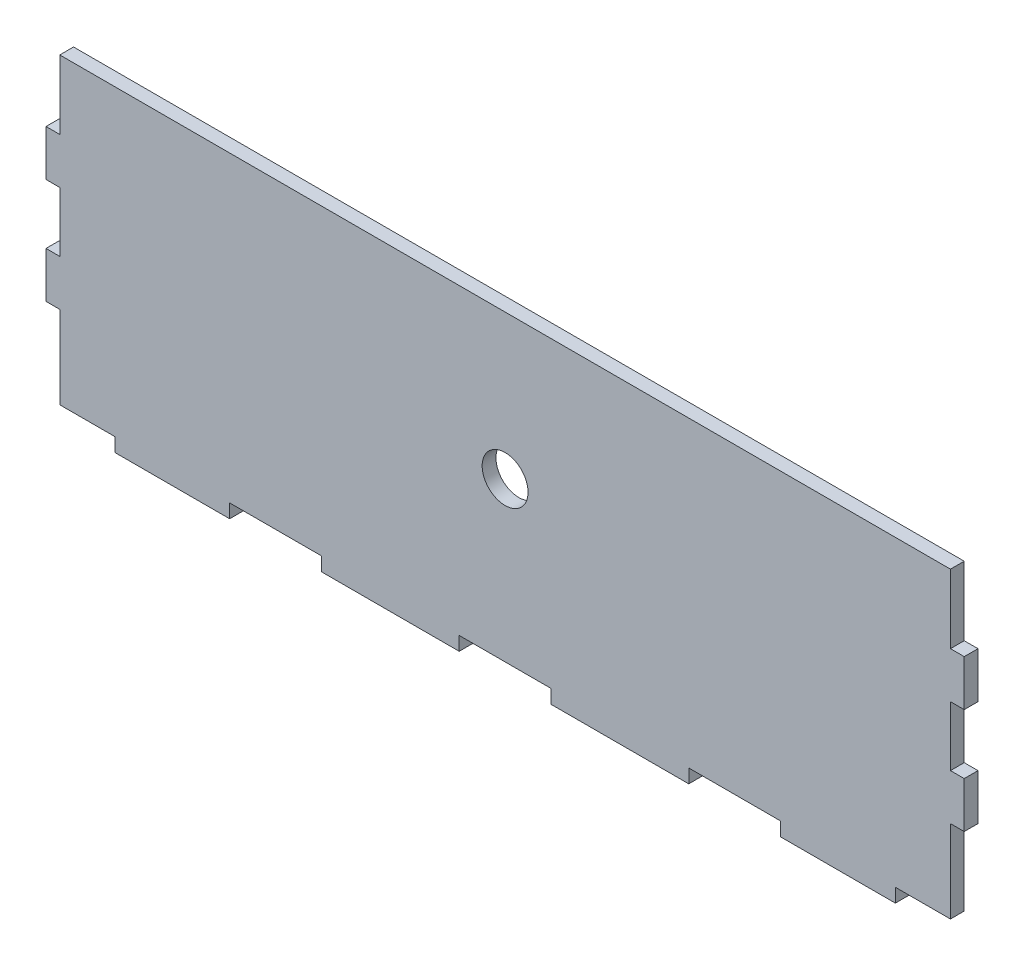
ISO-10303-21;
HEADER;
FILE_DESCRIPTION(('STEP AP214'),'2;1');
FILE_NAME('part.step','',(''),(''),'','','');
FILE_SCHEMA(('AUTOMOTIVE_DESIGN { 1 0 10303 214 1 1 1 1 }'));
ENDSEC;
DATA;
#1=APPLICATION_CONTEXT('core data for automotive mechanical design processes');
#2=APPLICATION_PROTOCOL_DEFINITION('international standard','automotive_design',2000,#1);
#3=PRODUCT_CONTEXT('',#1,'mechanical');
#4=PRODUCT('Part','Part','',(#3));
#5=PRODUCT_RELATED_PRODUCT_CATEGORY('part','',(#4));
#6=PRODUCT_DEFINITION_FORMATION('','',#4);
#7=PRODUCT_DEFINITION_CONTEXT('part definition',#1,'design');
#8=PRODUCT_DEFINITION('design','',#6,#7);
#9=PRODUCT_DEFINITION_SHAPE('','',#8);
#10=(LENGTH_UNIT() NAMED_UNIT(*) SI_UNIT(.MILLI.,.METRE.));
#11=(NAMED_UNIT(*) PLANE_ANGLE_UNIT() SI_UNIT($,.RADIAN.));
#12=(NAMED_UNIT(*) SI_UNIT($,.STERADIAN.) SOLID_ANGLE_UNIT());
#13=UNCERTAINTY_MEASURE_WITH_UNIT(LENGTH_MEASURE(1.E-05),#10,'distance_accuracy_value','');
#14=(GEOMETRIC_REPRESENTATION_CONTEXT(3) GLOBAL_UNCERTAINTY_ASSIGNED_CONTEXT((#13)) GLOBAL_UNIT_ASSIGNED_CONTEXT((#10,
#11,#12)) REPRESENTATION_CONTEXT('',''));
#15=CARTESIAN_POINT('',(0.,0.,0.));
#16=DIRECTION('',(0.,0.,1.));
#17=DIRECTION('',(1.,0.,0.));
#18=AXIS2_PLACEMENT_3D('',#15,#16,#17);
#19=CARTESIAN_POINT('',(0.,0.,3.));
#20=DIRECTION('',(1.,0.,0.));
#21=DIRECTION('',(0.,0.,-1.));
#22=AXIS2_PLACEMENT_3D('',#19,#20,#21);
#23=PLANE('',#22);
#24=DIRECTION('',(0.,-1.,0.));
#25=VECTOR('',#24,1.);
#26=CARTESIAN_POINT('',(0.,0.,3.));
#27=LINE('',#26,#25);
#28=CARTESIAN_POINT('',(0.,31.,3.));
#29=VERTEX_POINT('',#28);
#30=CARTESIAN_POINT('',(0.,21.,3.));
#31=VERTEX_POINT('',#30);
#32=EDGE_CURVE('E300',#29,#31,#27,.T.);
#33=ORIENTED_EDGE('',*,*,#32,.F.);
#34=DIRECTION('',(0.,0.,1.));
#35=VECTOR('',#34,1.);
#36=CARTESIAN_POINT('',(0.,31.,-3.));
#37=LINE('',#36,#35);
#38=CARTESIAN_POINT('',(0.,31.,0.));
#39=VERTEX_POINT('',#38);
#40=EDGE_CURVE('E488',#39,#29,#37,.T.);
#41=ORIENTED_EDGE('',*,*,#40,.F.);
#42=DIRECTION('',(0.,-1.,0.));
#43=VECTOR('',#42,1.);
#44=CARTESIAN_POINT('',(0.,0.,0.));
#45=LINE('',#44,#43);
#46=CARTESIAN_POINT('',(0.,21.,0.));
#47=VERTEX_POINT('',#46);
#48=EDGE_CURVE('E318',#39,#47,#45,.T.);
#49=ORIENTED_EDGE('',*,*,#48,.T.);
#50=DIRECTION('',(0.,0.,1.));
#51=VECTOR('',#50,1.);
#52=CARTESIAN_POINT('',(0.,21.,-3.));
#53=LINE('',#52,#51);
#54=EDGE_CURVE('E585',#47,#31,#53,.T.);
#55=ORIENTED_EDGE('',*,*,#54,.T.);
#56=EDGE_LOOP('',(#33,#41,#49,#55));
#57=FACE_BOUND('',#56,.T.);
#58=ADVANCED_FACE('F39',(#57),#23,.F.);
#59=CARTESIAN_POINT('',(0.,0.,3.));
#60=DIRECTION('',(0.,1.,0.));
#61=DIRECTION('',(0.,0.,1.));
#62=AXIS2_PLACEMENT_3D('',#59,#60,#61);
#63=PLANE('',#62);
#64=DIRECTION('',(1.,0.,0.));
#65=VECTOR('',#64,1.);
#66=CARTESIAN_POINT('',(0.,0.,3.));
#67=LINE('',#66,#65);
#68=CARTESIAN_POINT('',(60.,0.,3.));
#69=VERTEX_POINT('',#68);
#70=CARTESIAN_POINT('',(90.,0.,3.));
#71=VERTEX_POINT('',#70);
#72=EDGE_CURVE('E750',#69,#71,#67,.T.);
#73=ORIENTED_EDGE('',*,*,#72,.F.);
#74=DIRECTION('',(0.,0.,1.));
#75=VECTOR('',#74,1.);
#76=CARTESIAN_POINT('',(60.,0.,-3.));
#77=LINE('',#76,#75);
#78=CARTESIAN_POINT('',(60.,0.,0.));
#79=VERTEX_POINT('',#78);
#80=EDGE_CURVE('E464',#79,#69,#77,.T.);
#81=ORIENTED_EDGE('',*,*,#80,.F.);
#82=DIRECTION('',(1.,0.,0.));
#83=VECTOR('',#82,1.);
#84=CARTESIAN_POINT('',(0.,0.,0.));
#85=LINE('',#84,#83);
#86=CARTESIAN_POINT('',(90.,0.,0.));
#87=VERTEX_POINT('',#86);
#88=EDGE_CURVE('E709',#79,#87,#85,.T.);
#89=ORIENTED_EDGE('',*,*,#88,.T.);
#90=DIRECTION('',(0.,0.,1.));
#91=VECTOR('',#90,1.);
#92=CARTESIAN_POINT('',(90.,0.,-3.));
#93=LINE('',#92,#91);
#94=EDGE_CURVE('E564',#87,#71,#93,.T.);
#95=ORIENTED_EDGE('',*,*,#94,.T.);
#96=EDGE_LOOP('',(#73,#81,#89,#95));
#97=FACE_BOUND('',#96,.T.);
#98=ADVANCED_FACE('F671',(#97),#63,.F.);
#99=CARTESIAN_POINT('',(160.,0.,0.));
#100=VERTEX_POINT('',#99);
#101=CARTESIAN_POINT('',(185.,0.,0.));
#102=VERTEX_POINT('',#101);
#103=EDGE_CURVE('E324',#100,#102,#85,.T.);
#104=ORIENTED_EDGE('',*,*,#103,.T.);
#105=DIRECTION('',(0.,0.,1.));
#106=VECTOR('',#105,1.);
#107=CARTESIAN_POINT('',(185.,0.,-3.));
#108=LINE('',#107,#106);
#109=CARTESIAN_POINT('',(185.,0.,3.));
#110=VERTEX_POINT('',#109);
#111=EDGE_CURVE('E311',#102,#110,#108,.T.);
#112=ORIENTED_EDGE('',*,*,#111,.T.);
#113=CARTESIAN_POINT('',(160.,0.,3.));
#114=VERTEX_POINT('',#113);
#115=EDGE_CURVE('E299',#114,#110,#67,.T.);
#116=ORIENTED_EDGE('',*,*,#115,.F.);
#117=DIRECTION('',(0.,0.,1.));
#118=VECTOR('',#117,1.);
#119=CARTESIAN_POINT('',(160.,0.,-3.));
#120=LINE('',#119,#118);
#121=EDGE_CURVE('E539',#100,#114,#120,.T.);
#122=ORIENTED_EDGE('',*,*,#121,.F.);
#123=EDGE_LOOP('',(#104,#112,#116,#122));
#124=FACE_BOUND('',#123,.T.);
#125=ADVANCED_FACE('F629',(#124),#63,.F.);
#126=CARTESIAN_POINT('',(110.,0.,0.));
#127=VERTEX_POINT('',#126);
#128=CARTESIAN_POINT('',(140.,0.,0.));
#129=VERTEX_POINT('',#128);
#130=EDGE_CURVE('E328',#127,#129,#85,.T.);
#131=ORIENTED_EDGE('',*,*,#130,.T.);
#132=DIRECTION('',(0.,0.,1.));
#133=VECTOR('',#132,1.);
#134=CARTESIAN_POINT('',(140.,0.,-3.));
#135=LINE('',#134,#133);
#136=CARTESIAN_POINT('',(140.,0.,3.));
#137=VERTEX_POINT('',#136);
#138=EDGE_CURVE('E542',#129,#137,#135,.T.);
#139=ORIENTED_EDGE('',*,*,#138,.T.);
#140=CARTESIAN_POINT('',(110.,0.,3.));
#141=VERTEX_POINT('',#140);
#142=EDGE_CURVE('E305',#141,#137,#67,.T.);
#143=ORIENTED_EDGE('',*,*,#142,.F.);
#144=DIRECTION('',(0.,0.,1.));
#145=VECTOR('',#144,1.);
#146=CARTESIAN_POINT('',(110.,0.,-3.));
#147=LINE('',#146,#145);
#148=EDGE_CURVE('E561',#127,#141,#147,.T.);
#149=ORIENTED_EDGE('',*,*,#148,.F.);
#150=EDGE_LOOP('',(#131,#139,#143,#149));
#151=FACE_BOUND('',#150,.T.);
#152=ADVANCED_FACE('F687',(#151),#63,.F.);
#153=CARTESIAN_POINT('',(200.,0.,3.));
#154=DIRECTION('',(-1.,0.,0.));
#155=DIRECTION('',(0.,0.,1.));
#156=AXIS2_PLACEMENT_3D('',#153,#154,#155);
#157=PLANE('',#156);
#158=DIRECTION('',(0.,1.,0.));
#159=VECTOR('',#158,1.);
#160=CARTESIAN_POINT('',(200.,0.,0.));
#161=LINE('',#160,#159);
#162=CARTESIAN_POINT('',(200.,44.,0.));
#163=VERTEX_POINT('',#162);
#164=CARTESIAN_POINT('',(200.,54.,0.));
#165=VERTEX_POINT('',#164);
#166=EDGE_CURVE('E330',#163,#165,#161,.T.);
#167=ORIENTED_EDGE('',*,*,#166,.T.);
#168=DIRECTION('',(0.,0.,1.));
#169=VECTOR('',#168,1.);
#170=CARTESIAN_POINT('',(200.,54.,-3.));
#171=LINE('',#170,#169);
#172=CARTESIAN_POINT('',(200.,54.,3.));
#173=VERTEX_POINT('',#172);
#174=EDGE_CURVE('E407',#165,#173,#171,.T.);
#175=ORIENTED_EDGE('',*,*,#174,.T.);
#176=DIRECTION('',(0.,1.,0.));
#177=VECTOR('',#176,1.);
#178=CARTESIAN_POINT('',(200.,0.,3.));
#179=LINE('',#178,#177);
#180=CARTESIAN_POINT('',(200.,44.,3.));
#181=VERTEX_POINT('',#180);
#182=EDGE_CURVE('E314',#181,#173,#179,.T.);
#183=ORIENTED_EDGE('',*,*,#182,.F.);
#184=DIRECTION('',(0.,0.,1.));
#185=VECTOR('',#184,1.);
#186=CARTESIAN_POINT('',(200.,44.,-3.));
#187=LINE('',#186,#185);
#188=EDGE_CURVE('E510',#163,#181,#187,.T.);
#189=ORIENTED_EDGE('',*,*,#188,.F.);
#190=EDGE_LOOP('',(#167,#175,#183,#189));
#191=FACE_BOUND('',#190,.T.);
#192=ADVANCED_FACE('F680',(#191),#157,.F.);
#193=CARTESIAN_POINT('',(0.,54.,3.));
#194=VERTEX_POINT('',#193);
#195=CARTESIAN_POINT('',(0.,44.,3.));
#196=VERTEX_POINT('',#195);
#197=EDGE_CURVE('E289',#194,#196,#27,.T.);
#198=ORIENTED_EDGE('',*,*,#197,.F.);
#199=DIRECTION('',(0.,0.,1.));
#200=VECTOR('',#199,1.);
#201=CARTESIAN_POINT('',(0.,54.,-3.));
#202=LINE('',#201,#200);
#203=CARTESIAN_POINT('',(0.,54.,0.));
#204=VERTEX_POINT('',#203);
#205=EDGE_CURVE('E270',#204,#194,#202,.T.);
#206=ORIENTED_EDGE('',*,*,#205,.F.);
#207=CARTESIAN_POINT('',(0.,44.,0.));
#208=VERTEX_POINT('',#207);
#209=EDGE_CURVE('E322',#204,#208,#45,.T.);
#210=ORIENTED_EDGE('',*,*,#209,.T.);
#211=DIRECTION('',(0.,0.,1.));
#212=VECTOR('',#211,1.);
#213=CARTESIAN_POINT('',(0.,44.,-3.));
#214=LINE('',#213,#212);
#215=EDGE_CURVE('E297',#208,#196,#214,.T.);
#216=ORIENTED_EDGE('',*,*,#215,.T.);
#217=EDGE_LOOP('',(#198,#206,#210,#216));
#218=FACE_BOUND('',#217,.T.);
#219=ADVANCED_FACE('F41',(#218),#23,.F.);
#220=CARTESIAN_POINT('',(15.,0.,0.));
#221=VERTEX_POINT('',#220);
#222=CARTESIAN_POINT('',(40.,0.,0.));
#223=VERTEX_POINT('',#222);
#224=EDGE_CURVE('E329',#221,#223,#85,.T.);
#225=ORIENTED_EDGE('',*,*,#224,.T.);
#226=DIRECTION('',(0.,0.,1.));
#227=VECTOR('',#226,1.);
#228=CARTESIAN_POINT('',(40.,0.,-3.));
#229=LINE('',#228,#227);
#230=CARTESIAN_POINT('',(40.,0.,3.));
#231=VERTEX_POINT('',#230);
#232=EDGE_CURVE('E467',#223,#231,#229,.T.);
#233=ORIENTED_EDGE('',*,*,#232,.T.);
#234=CARTESIAN_POINT('',(15.,0.,3.));
#235=VERTEX_POINT('',#234);
#236=EDGE_CURVE('E307',#235,#231,#67,.T.);
#237=ORIENTED_EDGE('',*,*,#236,.F.);
#238=DIRECTION('',(0.,0.,1.));
#239=VECTOR('',#238,1.);
#240=CARTESIAN_POINT('',(15.,0.,-3.));
#241=LINE('',#240,#239);
#242=EDGE_CURVE('E593',#221,#235,#241,.T.);
#243=ORIENTED_EDGE('',*,*,#242,.F.);
#244=EDGE_LOOP('',(#225,#233,#237,#243));
#245=FACE_BOUND('',#244,.T.);
#246=ADVANCED_FACE('F677',(#245),#63,.F.);
#247=CARTESIAN_POINT('',(200.,21.,0.));
#248=VERTEX_POINT('',#247);
#249=CARTESIAN_POINT('',(200.,31.,0.));
#250=VERTEX_POINT('',#249);
#251=EDGE_CURVE('E309',#248,#250,#161,.T.);
#252=ORIENTED_EDGE('',*,*,#251,.T.);
#253=DIRECTION('',(0.,0.,1.));
#254=VECTOR('',#253,1.);
#255=CARTESIAN_POINT('',(200.,31.,-3.));
#256=LINE('',#255,#254);
#257=CARTESIAN_POINT('',(200.,31.,3.));
#258=VERTEX_POINT('',#257);
#259=EDGE_CURVE('E513',#250,#258,#256,.T.);
#260=ORIENTED_EDGE('',*,*,#259,.T.);
#261=CARTESIAN_POINT('',(200.,21.,3.));
#262=VERTEX_POINT('',#261);
#263=EDGE_CURVE('E317',#262,#258,#179,.T.);
#264=ORIENTED_EDGE('',*,*,#263,.F.);
#265=DIRECTION('',(0.,0.,1.));
#266=VECTOR('',#265,1.);
#267=CARTESIAN_POINT('',(200.,21.,-3.));
#268=LINE('',#267,#266);
#269=EDGE_CURVE('E620',#248,#262,#268,.T.);
#270=ORIENTED_EDGE('',*,*,#269,.F.);
#271=EDGE_LOOP('',(#252,#260,#264,#270));
#272=FACE_BOUND('',#271,.T.);
#273=ADVANCED_FACE('F685',(#272),#157,.F.);
#274=CARTESIAN_POINT('',(0.,0.,3.));
#275=DIRECTION('',(0.,0.,-1.));
#276=DIRECTION('',(-1.,0.,0.));
#277=AXIS2_PLACEMENT_3D('',#274,#275,#276);
#278=PLANE('',#277);
#279=CARTESIAN_POINT('',(100.,37.5,3.));
#280=DIRECTION('',(0.,0.,1.));
#281=DIRECTION('',(1.,0.,0.));
#282=AXIS2_PLACEMENT_3D('',#279,#280,#281);
#283=CIRCLE('',#282,5.00000000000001);
#284=CARTESIAN_POINT('',(105.,37.5,3.));
#285=VERTEX_POINT('',#284);
#286=EDGE_CURVE('E500',#285,#285,#283,.T.);
#287=ORIENTED_EDGE('',*,*,#286,.F.);
#288=EDGE_LOOP('',(#287));
#289=FACE_BOUND('',#288,.T.);
#290=ORIENTED_EDGE('',*,*,#182,.T.);
#291=DIRECTION('',(1.,0.,0.));
#292=VECTOR('',#291,1.);
#293=CARTESIAN_POINT('',(200.,54.,3.));
#294=LINE('',#293,#292);
#295=CARTESIAN_POINT('',(197.,54.,3.));
#296=VERTEX_POINT('',#295);
#297=EDGE_CURVE('E282',#296,#173,#294,.T.);
#298=ORIENTED_EDGE('',*,*,#297,.F.);
#299=DIRECTION('',(0.,-1.,0.));
#300=VECTOR('',#299,1.);
#301=CARTESIAN_POINT('',(197.,54.,3.));
#302=LINE('',#301,#300);
#303=CARTESIAN_POINT('',(197.,69.,3.));
#304=VERTEX_POINT('',#303);
#305=EDGE_CURVE('E722',#304,#296,#302,.T.);
#306=ORIENTED_EDGE('',*,*,#305,.F.);
#307=DIRECTION('',(1.,0.,0.));
#308=VECTOR('',#307,1.);
#309=CARTESIAN_POINT('',(197.,69.,3.));
#310=LINE('',#309,#308);
#311=CARTESIAN_POINT('',(3.,69.,3.));
#312=VERTEX_POINT('',#311);
#313=EDGE_CURVE('E431',#312,#304,#310,.T.);
#314=ORIENTED_EDGE('',*,*,#313,.F.);
#315=DIRECTION('',(0.,1.,0.));
#316=VECTOR('',#315,1.);
#317=CARTESIAN_POINT('',(3.,69.,3.));
#318=LINE('',#317,#316);
#319=CARTESIAN_POINT('',(3.,54.,3.));
#320=VERTEX_POINT('',#319);
#321=EDGE_CURVE('E292',#320,#312,#318,.T.);
#322=ORIENTED_EDGE('',*,*,#321,.F.);
#323=DIRECTION('',(1.,0.,0.));
#324=VECTOR('',#323,1.);
#325=CARTESIAN_POINT('',(3.,54.,3.));
#326=LINE('',#325,#324);
#327=EDGE_CURVE('E273',#194,#320,#326,.T.);
#328=ORIENTED_EDGE('',*,*,#327,.F.);
#329=ORIENTED_EDGE('',*,*,#197,.T.);
#330=DIRECTION('',(-1.,0.,0.));
#331=VECTOR('',#330,1.);
#332=CARTESIAN_POINT('',(3.,44.,3.));
#333=LINE('',#332,#331);
#334=CARTESIAN_POINT('',(3.,44.,3.));
#335=VERTEX_POINT('',#334);
#336=EDGE_CURVE('E477',#335,#196,#333,.T.);
#337=ORIENTED_EDGE('',*,*,#336,.F.);
#338=DIRECTION('',(0.,1.,0.));
#339=VECTOR('',#338,1.);
#340=CARTESIAN_POINT('',(3.,44.,3.));
#341=LINE('',#340,#339);
#342=CARTESIAN_POINT('',(3.,31.,3.));
#343=VERTEX_POINT('',#342);
#344=EDGE_CURVE('E473',#343,#335,#341,.T.);
#345=ORIENTED_EDGE('',*,*,#344,.F.);
#346=DIRECTION('',(1.,0.,0.));
#347=VECTOR('',#346,1.);
#348=CARTESIAN_POINT('',(3.,31.,3.));
#349=LINE('',#348,#347);
#350=EDGE_CURVE('E481',#29,#343,#349,.T.);
#351=ORIENTED_EDGE('',*,*,#350,.F.);
#352=ORIENTED_EDGE('',*,*,#32,.T.);
#353=DIRECTION('',(-1.,0.,0.));
#354=VECTOR('',#353,1.);
#355=CARTESIAN_POINT('',(3.,21.,3.));
#356=LINE('',#355,#354);
#357=CARTESIAN_POINT('',(3.,21.,3.));
#358=VERTEX_POINT('',#357);
#359=EDGE_CURVE('E570',#358,#31,#356,.T.);
#360=ORIENTED_EDGE('',*,*,#359,.F.);
#361=DIRECTION('',(0.,1.,0.));
#362=VECTOR('',#361,1.);
#363=CARTESIAN_POINT('',(3.00000000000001,3.,3.));
#364=LINE('',#363,#362);
#365=CARTESIAN_POINT('',(3.00000000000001,3.,3.));
#366=VERTEX_POINT('',#365);
#367=EDGE_CURVE('E581',#366,#358,#364,.T.);
#368=ORIENTED_EDGE('',*,*,#367,.F.);
#369=DIRECTION('',(-1.,0.,0.));
#370=VECTOR('',#369,1.);
#371=CARTESIAN_POINT('',(15.,3.,3.));
#372=LINE('',#371,#370);
#373=CARTESIAN_POINT('',(15.,3.,3.));
#374=VERTEX_POINT('',#373);
#375=EDGE_CURVE('E577',#374,#366,#372,.T.);
#376=ORIENTED_EDGE('',*,*,#375,.F.);
#377=DIRECTION('',(0.,1.,0.));
#378=VECTOR('',#377,1.);
#379=CARTESIAN_POINT('',(15.,0.,3.));
#380=LINE('',#379,#378);
#381=EDGE_CURVE('E573',#235,#374,#380,.T.);
#382=ORIENTED_EDGE('',*,*,#381,.F.);
#383=ORIENTED_EDGE('',*,*,#236,.T.);
#384=DIRECTION('',(0.,-1.,0.));
#385=VECTOR('',#384,1.);
#386=CARTESIAN_POINT('',(40.,3.,3.));
#387=LINE('',#386,#385);
#388=CARTESIAN_POINT('',(40.,3.,3.));
#389=VERTEX_POINT('',#388);
#390=EDGE_CURVE('E451',#389,#231,#387,.T.);
#391=ORIENTED_EDGE('',*,*,#390,.F.);
#392=DIRECTION('',(-1.,0.,0.));
#393=VECTOR('',#392,1.);
#394=CARTESIAN_POINT('',(40.,3.,3.));
#395=LINE('',#394,#393);
#396=CARTESIAN_POINT('',(60.,3.,3.));
#397=VERTEX_POINT('',#396);
#398=EDGE_CURVE('E447',#397,#389,#395,.T.);
#399=ORIENTED_EDGE('',*,*,#398,.F.);
#400=DIRECTION('',(0.,1.,0.));
#401=VECTOR('',#400,1.);
#402=CARTESIAN_POINT('',(60.,3.,3.));
#403=LINE('',#402,#401);
#404=EDGE_CURVE('E455',#69,#397,#403,.T.);
#405=ORIENTED_EDGE('',*,*,#404,.F.);
#406=ORIENTED_EDGE('',*,*,#72,.T.);
#407=DIRECTION('',(0.,-1.,0.));
#408=VECTOR('',#407,1.);
#409=CARTESIAN_POINT('',(90.,3.,3.));
#410=LINE('',#409,#408);
#411=CARTESIAN_POINT('',(90.,3.,3.));
#412=VERTEX_POINT('',#411);
#413=EDGE_CURVE('E551',#412,#71,#410,.T.);
#414=ORIENTED_EDGE('',*,*,#413,.F.);
#415=DIRECTION('',(-1.,0.,0.));
#416=VECTOR('',#415,1.);
#417=CARTESIAN_POINT('',(90.,3.,3.));
#418=LINE('',#417,#416);
#419=CARTESIAN_POINT('',(110.,3.,3.));
#420=VERTEX_POINT('',#419);
#421=EDGE_CURVE('E463',#420,#412,#418,.T.);
#422=ORIENTED_EDGE('',*,*,#421,.F.);
#423=DIRECTION('',(0.,1.,0.));
#424=VECTOR('',#423,1.);
#425=CARTESIAN_POINT('',(110.,3.,3.));
#426=LINE('',#425,#424);
#427=EDGE_CURVE('E554',#141,#420,#426,.T.);
#428=ORIENTED_EDGE('',*,*,#427,.F.);
#429=ORIENTED_EDGE('',*,*,#142,.T.);
#430=DIRECTION('',(0.,-1.,0.));
#431=VECTOR('',#430,1.);
#432=CARTESIAN_POINT('',(140.,3.,3.));
#433=LINE('',#432,#431);
#434=CARTESIAN_POINT('',(140.,3.,3.));
#435=VERTEX_POINT('',#434);
#436=EDGE_CURVE('E526',#435,#137,#433,.T.);
#437=ORIENTED_EDGE('',*,*,#436,.F.);
#438=DIRECTION('',(-1.,0.,0.));
#439=VECTOR('',#438,1.);
#440=CARTESIAN_POINT('',(140.,3.,3.));
#441=LINE('',#440,#439);
#442=CARTESIAN_POINT('',(160.,3.,3.));
#443=VERTEX_POINT('',#442);
#444=EDGE_CURVE('E522',#443,#435,#441,.T.);
#445=ORIENTED_EDGE('',*,*,#444,.F.);
#446=DIRECTION('',(0.,1.,0.));
#447=VECTOR('',#446,1.);
#448=CARTESIAN_POINT('',(160.,3.,3.));
#449=LINE('',#448,#447);
#450=EDGE_CURVE('E530',#114,#443,#449,.T.);
#451=ORIENTED_EDGE('',*,*,#450,.F.);
#452=ORIENTED_EDGE('',*,*,#115,.T.);
#453=DIRECTION('',(0.,-1.,0.));
#454=VECTOR('',#453,1.);
#455=CARTESIAN_POINT('',(185.,0.,3.));
#456=LINE('',#455,#454);
#457=CARTESIAN_POINT('',(185.,3.,3.));
#458=VERTEX_POINT('',#457);
#459=EDGE_CURVE('E538',#458,#110,#456,.T.);
#460=ORIENTED_EDGE('',*,*,#459,.F.);
#461=DIRECTION('',(-1.,0.,0.));
#462=VECTOR('',#461,1.);
#463=CARTESIAN_POINT('',(185.,3.,3.));
#464=LINE('',#463,#462);
#465=CARTESIAN_POINT('',(197.000000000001,3.00000000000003,3.));
#466=VERTEX_POINT('',#465);
#467=EDGE_CURVE('E609',#466,#458,#464,.T.);
#468=ORIENTED_EDGE('',*,*,#467,.F.);
#469=DIRECTION('',(0.,-1.,0.));
#470=VECTOR('',#469,1.);
#471=CARTESIAN_POINT('',(197.000000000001,21.,3.));
#472=LINE('',#471,#470);
#473=CARTESIAN_POINT('',(197.000000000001,21.,3.));
#474=VERTEX_POINT('',#473);
#475=EDGE_CURVE('E605',#474,#466,#472,.T.);
#476=ORIENTED_EDGE('',*,*,#475,.F.);
#477=DIRECTION('',(-1.,0.,0.));
#478=VECTOR('',#477,1.);
#479=CARTESIAN_POINT('',(197.000000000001,21.,3.));
#480=LINE('',#479,#478);
#481=EDGE_CURVE('E601',#262,#474,#480,.T.);
#482=ORIENTED_EDGE('',*,*,#481,.F.);
#483=ORIENTED_EDGE('',*,*,#263,.T.);
#484=DIRECTION('',(1.,0.,0.));
#485=VECTOR('',#484,1.);
#486=CARTESIAN_POINT('',(197.,31.,3.));
#487=LINE('',#486,#485);
#488=CARTESIAN_POINT('',(197.,31.,3.));
#489=VERTEX_POINT('',#488);
#490=EDGE_CURVE('E499',#489,#258,#487,.T.);
#491=ORIENTED_EDGE('',*,*,#490,.F.);
#492=DIRECTION('',(0.,-1.,0.));
#493=VECTOR('',#492,1.);
#494=CARTESIAN_POINT('',(197.,31.,3.));
#495=LINE('',#494,#493);
#496=CARTESIAN_POINT('',(197.,44.,3.));
#497=VERTEX_POINT('',#496);
#498=EDGE_CURVE('E495',#497,#489,#495,.T.);
#499=ORIENTED_EDGE('',*,*,#498,.F.);
#500=DIRECTION('',(-1.,0.,0.));
#501=VECTOR('',#500,1.);
#502=CARTESIAN_POINT('',(197.,44.,3.));
#503=LINE('',#502,#501);
#504=EDGE_CURVE('E503',#181,#497,#503,.T.);
#505=ORIENTED_EDGE('',*,*,#504,.F.);
#506=EDGE_LOOP('',(#290,#298,#306,#314,#322,#328,#329,#337,#345,#351,#352,#360,#368,#376,#382,
#383,#391,#399,#405,#406,#414,#422,#428,#429,#437,#445,#451,#452,#460,#468,#476,#482,#483,#491,
#499,#505));
#507=FACE_BOUND('',#506,.T.);
#508=ADVANCED_FACE('F287',(#289,#507),#278,.F.);
#509=CARTESIAN_POINT('',(0.,0.,0.));
#510=DIRECTION('',(0.,0.,-1.));
#511=DIRECTION('',(-1.,0.,0.));
#512=AXIS2_PLACEMENT_3D('',#509,#510,#511);
#513=PLANE('',#512);
#514=DIRECTION('',(-1.,0.,0.));
#515=VECTOR('',#514,1.);
#516=CARTESIAN_POINT('',(0.,54.,0.));
#517=LINE('',#516,#515);
#518=CARTESIAN_POINT('',(197.,54.,0.));
#519=VERTEX_POINT('',#518);
#520=EDGE_CURVE('E11',#165,#519,#517,.T.);
#521=ORIENTED_EDGE('',*,*,#520,.F.);
#522=ORIENTED_EDGE('',*,*,#166,.F.);
#523=DIRECTION('',(1.,0.,0.));
#524=VECTOR('',#523,1.);
#525=CARTESIAN_POINT('',(0.,44.,0.));
#526=LINE('',#525,#524);
#527=CARTESIAN_POINT('',(197.,44.,0.));
#528=VERTEX_POINT('',#527);
#529=EDGE_CURVE('E401',#528,#163,#526,.T.);
#530=ORIENTED_EDGE('',*,*,#529,.F.);
#531=DIRECTION('',(0.,1.,0.));
#532=VECTOR('',#531,1.);
#533=CARTESIAN_POINT('',(197.,0.,0.));
#534=LINE('',#533,#532);
#535=CARTESIAN_POINT('',(197.,31.,0.));
#536=VERTEX_POINT('',#535);
#537=EDGE_CURVE('E398',#536,#528,#534,.T.);
#538=ORIENTED_EDGE('',*,*,#537,.F.);
#539=DIRECTION('',(-1.,0.,0.));
#540=VECTOR('',#539,1.);
#541=CARTESIAN_POINT('',(0.,31.,0.));
#542=LINE('',#541,#540);
#543=EDGE_CURVE('E395',#250,#536,#542,.T.);
#544=ORIENTED_EDGE('',*,*,#543,.F.);
#545=ORIENTED_EDGE('',*,*,#251,.F.);
#546=DIRECTION('',(1.,0.,0.));
#547=VECTOR('',#546,1.);
#548=CARTESIAN_POINT('',(1.94289029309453E-13,21.0000000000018,0.));
#549=LINE('',#548,#547);
#550=CARTESIAN_POINT('',(197.000000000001,21.,0.));
#551=VERTEX_POINT('',#550);
#552=EDGE_CURVE('E352',#551,#248,#549,.T.);
#553=ORIENTED_EDGE('',*,*,#552,.F.);
#554=DIRECTION('',(0.,1.,0.));
#555=VECTOR('',#554,1.);
#556=CARTESIAN_POINT('',(197.000000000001,0.,0.));
#557=LINE('',#556,#555);
#558=CARTESIAN_POINT('',(197.000000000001,3.00000000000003,0.));
#559=VERTEX_POINT('',#558);
#560=EDGE_CURVE('E355',#559,#551,#557,.T.);
#561=ORIENTED_EDGE('',*,*,#560,.F.);
#562=DIRECTION('',(1.,0.,0.));
#563=VECTOR('',#562,1.);
#564=CARTESIAN_POINT('',(0.,2.99999999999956,0.));
#565=LINE('',#564,#563);
#566=CARTESIAN_POINT('',(185.,3.,0.));
#567=VERTEX_POINT('',#566);
#568=EDGE_CURVE('E359',#567,#559,#565,.T.);
#569=ORIENTED_EDGE('',*,*,#568,.F.);
#570=DIRECTION('',(0.,1.,0.));
#571=VECTOR('',#570,1.);
#572=CARTESIAN_POINT('',(185.,0.,0.));
#573=LINE('',#572,#571);
#574=EDGE_CURVE('E362',#102,#567,#573,.T.);
#575=ORIENTED_EDGE('',*,*,#574,.F.);
#576=ORIENTED_EDGE('',*,*,#103,.F.);
#577=DIRECTION('',(0.,-1.,0.));
#578=VECTOR('',#577,1.);
#579=CARTESIAN_POINT('',(160.,0.,0.));
#580=LINE('',#579,#578);
#581=CARTESIAN_POINT('',(160.,3.,0.));
#582=VERTEX_POINT('',#581);
#583=EDGE_CURVE('E349',#582,#100,#580,.T.);
#584=ORIENTED_EDGE('',*,*,#583,.F.);
#585=DIRECTION('',(1.,0.,0.));
#586=VECTOR('',#585,1.);
#587=CARTESIAN_POINT('',(0.,3.,0.));
#588=LINE('',#587,#586);
#589=CARTESIAN_POINT('',(140.,3.,0.));
#590=VERTEX_POINT('',#589);
#591=EDGE_CURVE('E346',#590,#582,#588,.T.);
#592=ORIENTED_EDGE('',*,*,#591,.F.);
#593=DIRECTION('',(0.,1.,0.));
#594=VECTOR('',#593,1.);
#595=CARTESIAN_POINT('',(140.,0.,0.));
#596=LINE('',#595,#594);
#597=EDGE_CURVE('E343',#129,#590,#596,.T.);
#598=ORIENTED_EDGE('',*,*,#597,.F.);
#599=ORIENTED_EDGE('',*,*,#130,.F.);
#600=DIRECTION('',(0.,-1.,0.));
#601=VECTOR('',#600,1.);
#602=CARTESIAN_POINT('',(110.,0.,0.));
#603=LINE('',#602,#601);
#604=CARTESIAN_POINT('',(110.,3.,0.));
#605=VERTEX_POINT('',#604);
#606=EDGE_CURVE('E340',#605,#127,#603,.T.);
#607=ORIENTED_EDGE('',*,*,#606,.F.);
#608=DIRECTION('',(1.,0.,0.));
#609=VECTOR('',#608,1.);
#610=CARTESIAN_POINT('',(0.,3.,0.));
#611=LINE('',#610,#609);
#612=CARTESIAN_POINT('',(90.,3.,0.));
#613=VERTEX_POINT('',#612);
#614=EDGE_CURVE('E337',#613,#605,#611,.T.);
#615=ORIENTED_EDGE('',*,*,#614,.F.);
#616=DIRECTION('',(0.,1.,0.));
#617=VECTOR('',#616,1.);
#618=CARTESIAN_POINT('',(90.,0.,0.));
#619=LINE('',#618,#617);
#620=EDGE_CURVE('E334',#87,#613,#619,.T.);
#621=ORIENTED_EDGE('',*,*,#620,.F.);
#622=ORIENTED_EDGE('',*,*,#88,.F.);
#623=DIRECTION('',(0.,-1.,0.));
#624=VECTOR('',#623,1.);
#625=CARTESIAN_POINT('',(60.,0.,0.));
#626=LINE('',#625,#624);
#627=CARTESIAN_POINT('',(60.,3.,0.));
#628=VERTEX_POINT('',#627);
#629=EDGE_CURVE('E383',#628,#79,#626,.T.);
#630=ORIENTED_EDGE('',*,*,#629,.F.);
#631=DIRECTION('',(1.,0.,0.));
#632=VECTOR('',#631,1.);
#633=CARTESIAN_POINT('',(0.,3.,0.));
#634=LINE('',#633,#632);
#635=CARTESIAN_POINT('',(40.,3.,0.));
#636=VERTEX_POINT('',#635);
#637=EDGE_CURVE('E380',#636,#628,#634,.T.);
#638=ORIENTED_EDGE('',*,*,#637,.F.);
#639=DIRECTION('',(0.,1.,0.));
#640=VECTOR('',#639,1.);
#641=CARTESIAN_POINT('',(40.,0.,0.));
#642=LINE('',#641,#640);
#643=EDGE_CURVE('E377',#223,#636,#642,.T.);
#644=ORIENTED_EDGE('',*,*,#643,.F.);
#645=ORIENTED_EDGE('',*,*,#224,.F.);
#646=DIRECTION('',(0.,-1.,0.));
#647=VECTOR('',#646,1.);
#648=CARTESIAN_POINT('',(15.,0.,0.));
#649=LINE('',#648,#647);
#650=CARTESIAN_POINT('',(15.,3.,0.));
#651=VERTEX_POINT('',#650);
#652=EDGE_CURVE('E365',#651,#221,#649,.T.);
#653=ORIENTED_EDGE('',*,*,#652,.F.);
#654=DIRECTION('',(1.,0.,0.));
#655=VECTOR('',#654,1.);
#656=CARTESIAN_POINT('',(0.,3.,0.));
#657=LINE('',#656,#655);
#658=CARTESIAN_POINT('',(3.00000000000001,3.,0.));
#659=VERTEX_POINT('',#658);
#660=EDGE_CURVE('E368',#659,#651,#657,.T.);
#661=ORIENTED_EDGE('',*,*,#660,.F.);
#662=DIRECTION('',(0.,-1.,0.));
#663=VECTOR('',#662,1.);
#664=CARTESIAN_POINT('',(3.00000000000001,0.,0.));
#665=LINE('',#664,#663);
#666=CARTESIAN_POINT('',(3.,21.,0.));
#667=VERTEX_POINT('',#666);
#668=EDGE_CURVE('E371',#667,#659,#665,.T.);
#669=ORIENTED_EDGE('',*,*,#668,.F.);
#670=DIRECTION('',(1.,0.,0.));
#671=VECTOR('',#670,1.);
#672=CARTESIAN_POINT('',(0.,21.,0.));
#673=LINE('',#672,#671);
#674=EDGE_CURVE('E374',#47,#667,#673,.T.);
#675=ORIENTED_EDGE('',*,*,#674,.F.);
#676=ORIENTED_EDGE('',*,*,#48,.F.);
#677=DIRECTION('',(-1.,0.,0.));
#678=VECTOR('',#677,1.);
#679=CARTESIAN_POINT('',(0.,31.,0.));
#680=LINE('',#679,#678);
#681=CARTESIAN_POINT('',(3.,31.,0.));
#682=VERTEX_POINT('',#681);
#683=EDGE_CURVE('E392',#682,#39,#680,.T.);
#684=ORIENTED_EDGE('',*,*,#683,.F.);
#685=DIRECTION('',(0.,-1.,0.));
#686=VECTOR('',#685,1.);
#687=CARTESIAN_POINT('',(3.00000000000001,0.,0.));
#688=LINE('',#687,#686);
#689=CARTESIAN_POINT('',(3.,44.,0.));
#690=VERTEX_POINT('',#689);
#691=EDGE_CURVE('E389',#690,#682,#688,.T.);
#692=ORIENTED_EDGE('',*,*,#691,.F.);
#693=DIRECTION('',(1.,0.,0.));
#694=VECTOR('',#693,1.);
#695=CARTESIAN_POINT('',(0.,44.,0.));
#696=LINE('',#695,#694);
#697=EDGE_CURVE('E386',#208,#690,#696,.T.);
#698=ORIENTED_EDGE('',*,*,#697,.F.);
#699=ORIENTED_EDGE('',*,*,#209,.F.);
#700=DIRECTION('',(-1.,0.,0.));
#701=VECTOR('',#700,1.);
#702=CARTESIAN_POINT('',(0.,54.,0.));
#703=LINE('',#702,#701);
#704=CARTESIAN_POINT('',(3.,54.,0.));
#705=VERTEX_POINT('',#704);
#706=EDGE_CURVE('E276',#705,#204,#703,.T.);
#707=ORIENTED_EDGE('',*,*,#706,.F.);
#708=DIRECTION('',(0.,-1.,0.));
#709=VECTOR('',#708,1.);
#710=CARTESIAN_POINT('',(3.00000000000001,0.,0.));
#711=LINE('',#710,#709);
#712=CARTESIAN_POINT('',(3.,69.,0.));
#713=VERTEX_POINT('',#712);
#714=EDGE_CURVE('E410',#713,#705,#711,.T.);
#715=ORIENTED_EDGE('',*,*,#714,.F.);
#716=DIRECTION('',(-1.,0.,0.));
#717=VECTOR('',#716,1.);
#718=CARTESIAN_POINT('',(0.,69.,0.));
#719=LINE('',#718,#717);
#720=CARTESIAN_POINT('',(197.,69.,0.));
#721=VERTEX_POINT('',#720);
#722=EDGE_CURVE('E413',#721,#713,#719,.T.);
#723=ORIENTED_EDGE('',*,*,#722,.F.);
#724=DIRECTION('',(0.,1.,0.));
#725=VECTOR('',#724,1.);
#726=CARTESIAN_POINT('',(197.,0.,0.));
#727=LINE('',#726,#725);
#728=EDGE_CURVE('E48',#519,#721,#727,.T.);
#729=ORIENTED_EDGE('',*,*,#728,.F.);
#730=EDGE_LOOP('',(#521,#522,#530,#538,#544,#545,#553,#561,#569,#575,#576,#584,#592,#598,#599,
#607,#615,#621,#622,#630,#638,#644,#645,#653,#661,#669,#675,#676,#684,#692,#698,#699,#707,#715,
#723,#729));
#731=FACE_BOUND('',#730,.T.);
#732=CARTESIAN_POINT('',(100.,37.5,0.));
#733=DIRECTION('',(0.,0.,-1.));
#734=DIRECTION('',(-1.,0.,0.));
#735=AXIS2_PLACEMENT_3D('',#732,#733,#734);
#736=CIRCLE('',#735,5.00000000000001);
#737=CARTESIAN_POINT('',(95.,37.5,0.));
#738=VERTEX_POINT('',#737);
#739=EDGE_CURVE('E323',#738,#738,#736,.T.);
#740=ORIENTED_EDGE('',*,*,#739,.F.);
#741=EDGE_LOOP('',(#740));
#742=FACE_BOUND('',#741,.T.);
#743=ADVANCED_FACE('F437',(#731,#742),#513,.T.);
#744=CARTESIAN_POINT('',(90.,3.,-3.));
#745=DIRECTION('',(0.,1.,0.));
#746=DIRECTION('',(0.,0.,1.));
#747=AXIS2_PLACEMENT_3D('',#744,#745,#746);
#748=PLANE('',#747);
#749=ORIENTED_EDGE('',*,*,#614,.T.);
#750=DIRECTION('',(0.,0.,1.));
#751=VECTOR('',#750,1.);
#752=CARTESIAN_POINT('',(110.,3.,-3.));
#753=LINE('',#752,#751);
#754=EDGE_CURVE('E527',#605,#420,#753,.T.);
#755=ORIENTED_EDGE('',*,*,#754,.T.);
#756=ORIENTED_EDGE('',*,*,#421,.T.);
#757=DIRECTION('',(0.,0.,1.));
#758=VECTOR('',#757,1.);
#759=CARTESIAN_POINT('',(90.,3.,-3.));
#760=LINE('',#759,#758);
#761=EDGE_CURVE('E558',#613,#412,#760,.T.);
#762=ORIENTED_EDGE('',*,*,#761,.F.);
#763=EDGE_LOOP('',(#749,#755,#756,#762));
#764=FACE_BOUND('',#763,.T.);
#765=ADVANCED_FACE('F780',(#764),#748,.F.);
#766=CARTESIAN_POINT('',(110.,3.,-3.));
#767=DIRECTION('',(1.,0.,0.));
#768=DIRECTION('',(0.,0.,-1.));
#769=AXIS2_PLACEMENT_3D('',#766,#767,#768);
#770=PLANE('',#769);
#771=ORIENTED_EDGE('',*,*,#606,.T.);
#772=ORIENTED_EDGE('',*,*,#148,.T.);
#773=ORIENTED_EDGE('',*,*,#427,.T.);
#774=ORIENTED_EDGE('',*,*,#754,.F.);
#775=EDGE_LOOP('',(#771,#772,#773,#774));
#776=FACE_BOUND('',#775,.T.);
#777=ADVANCED_FACE('F774',(#776),#770,.F.);
#778=CARTESIAN_POINT('',(90.,3.,-3.));
#779=DIRECTION('',(-1.,0.,0.));
#780=DIRECTION('',(0.,0.,1.));
#781=AXIS2_PLACEMENT_3D('',#778,#779,#780);
#782=PLANE('',#781);
#783=ORIENTED_EDGE('',*,*,#620,.T.);
#784=ORIENTED_EDGE('',*,*,#761,.T.);
#785=ORIENTED_EDGE('',*,*,#413,.T.);
#786=ORIENTED_EDGE('',*,*,#94,.F.);
#787=EDGE_LOOP('',(#783,#784,#785,#786));
#788=FACE_BOUND('',#787,.T.);
#789=ADVANCED_FACE('F767',(#788),#782,.F.);
#790=CARTESIAN_POINT('',(140.,3.,-3.));
#791=DIRECTION('',(0.,1.,0.));
#792=DIRECTION('',(0.,0.,1.));
#793=AXIS2_PLACEMENT_3D('',#790,#791,#792);
#794=PLANE('',#793);
#795=ORIENTED_EDGE('',*,*,#591,.T.);
#796=DIRECTION('',(0.,0.,1.));
#797=VECTOR('',#796,1.);
#798=CARTESIAN_POINT('',(160.,3.,-3.));
#799=LINE('',#798,#797);
#800=EDGE_CURVE('E535',#582,#443,#799,.T.);
#801=ORIENTED_EDGE('',*,*,#800,.T.);
#802=ORIENTED_EDGE('',*,*,#444,.T.);
#803=DIRECTION('',(0.,0.,1.));
#804=VECTOR('',#803,1.);
#805=CARTESIAN_POINT('',(140.,3.,-3.));
#806=LINE('',#805,#804);
#807=EDGE_CURVE('E534',#590,#435,#806,.T.);
#808=ORIENTED_EDGE('',*,*,#807,.F.);
#809=EDGE_LOOP('',(#795,#801,#802,#808));
#810=FACE_BOUND('',#809,.T.);
#811=ADVANCED_FACE('F765',(#810),#794,.F.);
#812=CARTESIAN_POINT('',(160.,3.,-3.));
#813=DIRECTION('',(1.,0.,0.));
#814=DIRECTION('',(0.,0.,-1.));
#815=AXIS2_PLACEMENT_3D('',#812,#813,#814);
#816=PLANE('',#815);
#817=ORIENTED_EDGE('',*,*,#583,.T.);
#818=ORIENTED_EDGE('',*,*,#121,.T.);
#819=ORIENTED_EDGE('',*,*,#450,.T.);
#820=ORIENTED_EDGE('',*,*,#800,.F.);
#821=EDGE_LOOP('',(#817,#818,#819,#820));
#822=FACE_BOUND('',#821,.T.);
#823=ADVANCED_FACE('F641',(#822),#816,.F.);
#824=CARTESIAN_POINT('',(140.,3.,-3.));
#825=DIRECTION('',(-1.,0.,0.));
#826=DIRECTION('',(0.,0.,1.));
#827=AXIS2_PLACEMENT_3D('',#824,#825,#826);
#828=PLANE('',#827);
#829=ORIENTED_EDGE('',*,*,#597,.T.);
#830=ORIENTED_EDGE('',*,*,#807,.T.);
#831=ORIENTED_EDGE('',*,*,#436,.T.);
#832=ORIENTED_EDGE('',*,*,#138,.F.);
#833=EDGE_LOOP('',(#829,#830,#831,#832));
#834=FACE_BOUND('',#833,.T.);
#835=ADVANCED_FACE('F761',(#834),#828,.F.);
#836=CARTESIAN_POINT('',(185.,0.,-3.));
#837=DIRECTION('',(-1.,0.,0.));
#838=DIRECTION('',(0.,0.,1.));
#839=AXIS2_PLACEMENT_3D('',#836,#837,#838);
#840=PLANE('',#839);
#841=ORIENTED_EDGE('',*,*,#574,.T.);
#842=DIRECTION('',(0.,0.,1.));
#843=VECTOR('',#842,1.);
#844=CARTESIAN_POINT('',(185.,3.,-3.));
#845=LINE('',#844,#843);
#846=EDGE_CURVE('E574',#567,#458,#845,.T.);
#847=ORIENTED_EDGE('',*,*,#846,.T.);
#848=ORIENTED_EDGE('',*,*,#459,.T.);
#849=ORIENTED_EDGE('',*,*,#111,.F.);
#850=EDGE_LOOP('',(#841,#847,#848,#849));
#851=FACE_BOUND('',#850,.T.);
#852=ADVANCED_FACE('F647',(#851),#840,.F.);
#853=CARTESIAN_POINT('',(185.,3.,-3.));
#854=DIRECTION('',(0.,1.,0.));
#855=DIRECTION('',(-1.,0.,0.));
#856=AXIS2_PLACEMENT_3D('',#853,#854,#855);
#857=PLANE('',#856);
#858=ORIENTED_EDGE('',*,*,#568,.T.);
#859=DIRECTION('',(0.,0.,1.));
#860=VECTOR('',#859,1.);
#861=CARTESIAN_POINT('',(197.000000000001,3.00000000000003,-3.));
#862=LINE('',#861,#860);
#863=EDGE_CURVE('E615',#559,#466,#862,.T.);
#864=ORIENTED_EDGE('',*,*,#863,.T.);
#865=ORIENTED_EDGE('',*,*,#467,.T.);
#866=ORIENTED_EDGE('',*,*,#846,.F.);
#867=EDGE_LOOP('',(#858,#864,#865,#866));
#868=FACE_BOUND('',#867,.T.);
#869=ADVANCED_FACE('F649',(#868),#857,.F.);
#870=CARTESIAN_POINT('',(197.000000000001,21.,-3.));
#871=DIRECTION('',(-1.,0.,0.));
#872=DIRECTION('',(0.,0.,1.));
#873=AXIS2_PLACEMENT_3D('',#870,#871,#872);
#874=PLANE('',#873);
#875=ORIENTED_EDGE('',*,*,#560,.T.);
#876=DIRECTION('',(0.,0.,1.));
#877=VECTOR('',#876,1.);
#878=CARTESIAN_POINT('',(197.000000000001,21.,-3.));
#879=LINE('',#878,#877);
#880=EDGE_CURVE('E618',#551,#474,#879,.T.);
#881=ORIENTED_EDGE('',*,*,#880,.T.);
#882=ORIENTED_EDGE('',*,*,#475,.T.);
#883=ORIENTED_EDGE('',*,*,#863,.F.);
#884=EDGE_LOOP('',(#875,#881,#882,#883));
#885=FACE_BOUND('',#884,.T.);
#886=ADVANCED_FACE('F655',(#885),#874,.F.);
#887=CARTESIAN_POINT('',(197.000000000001,21.,-3.));
#888=DIRECTION('',(0.,1.,0.));
#889=DIRECTION('',(-1.,0.,0.));
#890=AXIS2_PLACEMENT_3D('',#887,#888,#889);
#891=PLANE('',#890);
#892=ORIENTED_EDGE('',*,*,#552,.T.);
#893=ORIENTED_EDGE('',*,*,#269,.T.);
#894=ORIENTED_EDGE('',*,*,#481,.T.);
#895=ORIENTED_EDGE('',*,*,#880,.F.);
#896=EDGE_LOOP('',(#892,#893,#894,#895));
#897=FACE_BOUND('',#896,.T.);
#898=ADVANCED_FACE('F657',(#897),#891,.F.);
#899=CARTESIAN_POINT('',(3.,21.,-3.));
#900=DIRECTION('',(0.,1.,0.));
#901=DIRECTION('',(0.,0.,1.));
#902=AXIS2_PLACEMENT_3D('',#899,#900,#901);
#903=PLANE('',#902);
#904=ORIENTED_EDGE('',*,*,#674,.T.);
#905=DIRECTION('',(0.,0.,1.));
#906=VECTOR('',#905,1.);
#907=CARTESIAN_POINT('',(3.,21.,-3.));
#908=LINE('',#907,#906);
#909=EDGE_CURVE('E294',#667,#358,#908,.T.);
#910=ORIENTED_EDGE('',*,*,#909,.T.);
#911=ORIENTED_EDGE('',*,*,#359,.T.);
#912=ORIENTED_EDGE('',*,*,#54,.F.);
#913=EDGE_LOOP('',(#904,#910,#911,#912));
#914=FACE_BOUND('',#913,.T.);
#915=ADVANCED_FACE('F659',(#914),#903,.F.);
#916=CARTESIAN_POINT('',(3.00000000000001,3.,-3.));
#917=DIRECTION('',(1.,0.,0.));
#918=DIRECTION('',(0.,1.,0.));
#919=AXIS2_PLACEMENT_3D('',#916,#917,#918);
#920=PLANE('',#919);
#921=ORIENTED_EDGE('',*,*,#668,.T.);
#922=DIRECTION('',(0.,0.,1.));
#923=VECTOR('',#922,1.);
#924=CARTESIAN_POINT('',(3.00000000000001,3.,-3.));
#925=LINE('',#924,#923);
#926=EDGE_CURVE('E588',#659,#366,#925,.T.);
#927=ORIENTED_EDGE('',*,*,#926,.T.);
#928=ORIENTED_EDGE('',*,*,#367,.T.);
#929=ORIENTED_EDGE('',*,*,#909,.F.);
#930=EDGE_LOOP('',(#921,#927,#928,#929));
#931=FACE_BOUND('',#930,.T.);
#932=ADVANCED_FACE('F665',(#931),#920,.F.);
#933=CARTESIAN_POINT('',(15.,3.,-3.));
#934=DIRECTION('',(0.,1.,0.));
#935=DIRECTION('',(0.,0.,1.));
#936=AXIS2_PLACEMENT_3D('',#933,#934,#935);
#937=PLANE('',#936);
#938=ORIENTED_EDGE('',*,*,#660,.T.);
#939=DIRECTION('',(0.,0.,1.));
#940=VECTOR('',#939,1.);
#941=CARTESIAN_POINT('',(15.,3.,-3.));
#942=LINE('',#941,#940);
#943=EDGE_CURVE('E63',#651,#374,#942,.T.);
#944=ORIENTED_EDGE('',*,*,#943,.T.);
#945=ORIENTED_EDGE('',*,*,#375,.T.);
#946=ORIENTED_EDGE('',*,*,#926,.F.);
#947=EDGE_LOOP('',(#938,#944,#945,#946));
#948=FACE_BOUND('',#947,.T.);
#949=ADVANCED_FACE('F788',(#948),#937,.F.);
#950=CARTESIAN_POINT('',(15.,0.,-3.));
#951=DIRECTION('',(1.,0.,0.));
#952=DIRECTION('',(0.,1.,0.));
#953=AXIS2_PLACEMENT_3D('',#950,#951,#952);
#954=PLANE('',#953);
#955=ORIENTED_EDGE('',*,*,#652,.T.);
#956=ORIENTED_EDGE('',*,*,#242,.T.);
#957=ORIENTED_EDGE('',*,*,#381,.T.);
#958=ORIENTED_EDGE('',*,*,#943,.F.);
#959=EDGE_LOOP('',(#955,#956,#957,#958));
#960=FACE_BOUND('',#959,.T.);
#961=ADVANCED_FACE('F792',(#960),#954,.F.);
#962=CARTESIAN_POINT('',(40.,3.,-3.));
#963=DIRECTION('',(0.,1.,0.));
#964=DIRECTION('',(0.,0.,1.));
#965=AXIS2_PLACEMENT_3D('',#962,#963,#964);
#966=PLANE('',#965);
#967=ORIENTED_EDGE('',*,*,#637,.T.);
#968=DIRECTION('',(0.,0.,1.));
#969=VECTOR('',#968,1.);
#970=CARTESIAN_POINT('',(60.,3.,-3.));
#971=LINE('',#970,#969);
#972=EDGE_CURVE('E460',#628,#397,#971,.T.);
#973=ORIENTED_EDGE('',*,*,#972,.T.);
#974=ORIENTED_EDGE('',*,*,#398,.T.);
#975=DIRECTION('',(0.,0.,1.));
#976=VECTOR('',#975,1.);
#977=CARTESIAN_POINT('',(40.,3.,-3.));
#978=LINE('',#977,#976);
#979=EDGE_CURVE('E459',#636,#389,#978,.T.);
#980=ORIENTED_EDGE('',*,*,#979,.F.);
#981=EDGE_LOOP('',(#967,#973,#974,#980));
#982=FACE_BOUND('',#981,.T.);
#983=ADVANCED_FACE('F795',(#982),#966,.F.);
#984=CARTESIAN_POINT('',(60.,3.,-3.));
#985=DIRECTION('',(1.,0.,0.));
#986=DIRECTION('',(0.,0.,-1.));
#987=AXIS2_PLACEMENT_3D('',#984,#985,#986);
#988=PLANE('',#987);
#989=ORIENTED_EDGE('',*,*,#629,.T.);
#990=ORIENTED_EDGE('',*,*,#80,.T.);
#991=ORIENTED_EDGE('',*,*,#404,.T.);
#992=ORIENTED_EDGE('',*,*,#972,.F.);
#993=EDGE_LOOP('',(#989,#990,#991,#992));
#994=FACE_BOUND('',#993,.T.);
#995=ADVANCED_FACE('F888',(#994),#988,.F.);
#996=CARTESIAN_POINT('',(40.,3.,-3.));
#997=DIRECTION('',(-1.,0.,0.));
#998=DIRECTION('',(0.,0.,1.));
#999=AXIS2_PLACEMENT_3D('',#996,#997,#998);
#1000=PLANE('',#999);
#1001=ORIENTED_EDGE('',*,*,#643,.T.);
#1002=ORIENTED_EDGE('',*,*,#979,.T.);
#1003=ORIENTED_EDGE('',*,*,#390,.T.);
#1004=ORIENTED_EDGE('',*,*,#232,.F.);
#1005=EDGE_LOOP('',(#1001,#1002,#1003,#1004));
#1006=FACE_BOUND('',#1005,.T.);
#1007=ADVANCED_FACE('F898',(#1006),#1000,.F.);
#1008=CARTESIAN_POINT('',(3.,44.,-3.));
#1009=DIRECTION('',(1.,0.,0.));
#1010=DIRECTION('',(0.,1.,0.));
#1011=AXIS2_PLACEMENT_3D('',#1008,#1009,#1010);
#1012=PLANE('',#1011);
#1013=ORIENTED_EDGE('',*,*,#691,.T.);
#1014=DIRECTION('',(0.,0.,1.));
#1015=VECTOR('',#1014,1.);
#1016=CARTESIAN_POINT('',(3.,31.,-3.));
#1017=LINE('',#1016,#1015);
#1018=EDGE_CURVE('E452',#682,#343,#1017,.T.);
#1019=ORIENTED_EDGE('',*,*,#1018,.T.);
#1020=ORIENTED_EDGE('',*,*,#344,.T.);
#1021=DIRECTION('',(0.,0.,1.));
#1022=VECTOR('',#1021,1.);
#1023=CARTESIAN_POINT('',(3.,44.,-3.));
#1024=LINE('',#1023,#1022);
#1025=EDGE_CURVE('E485',#690,#335,#1024,.T.);
#1026=ORIENTED_EDGE('',*,*,#1025,.F.);
#1027=EDGE_LOOP('',(#1013,#1019,#1020,#1026));
#1028=FACE_BOUND('',#1027,.T.);
#1029=ADVANCED_FACE('F908',(#1028),#1012,.F.);
#1030=CARTESIAN_POINT('',(3.,31.,-3.));
#1031=DIRECTION('',(0.,-1.,0.));
#1032=DIRECTION('',(0.,0.,-1.));
#1033=AXIS2_PLACEMENT_3D('',#1030,#1031,#1032);
#1034=PLANE('',#1033);
#1035=ORIENTED_EDGE('',*,*,#683,.T.);
#1036=ORIENTED_EDGE('',*,*,#40,.T.);
#1037=ORIENTED_EDGE('',*,*,#350,.T.);
#1038=ORIENTED_EDGE('',*,*,#1018,.F.);
#1039=EDGE_LOOP('',(#1035,#1036,#1037,#1038));
#1040=FACE_BOUND('',#1039,.T.);
#1041=ADVANCED_FACE('F918',(#1040),#1034,.F.);
#1042=CARTESIAN_POINT('',(3.,44.,-3.));
#1043=DIRECTION('',(0.,1.,0.));
#1044=DIRECTION('',(0.,0.,1.));
#1045=AXIS2_PLACEMENT_3D('',#1042,#1043,#1044);
#1046=PLANE('',#1045);
#1047=ORIENTED_EDGE('',*,*,#697,.T.);
#1048=ORIENTED_EDGE('',*,*,#1025,.T.);
#1049=ORIENTED_EDGE('',*,*,#336,.T.);
#1050=ORIENTED_EDGE('',*,*,#215,.F.);
#1051=EDGE_LOOP('',(#1047,#1048,#1049,#1050));
#1052=FACE_BOUND('',#1051,.T.);
#1053=ADVANCED_FACE('F928',(#1052),#1046,.F.);
#1054=CARTESIAN_POINT('',(197.,31.,-3.));
#1055=DIRECTION('',(-1.,0.,0.));
#1056=DIRECTION('',(0.,0.,1.));
#1057=AXIS2_PLACEMENT_3D('',#1054,#1055,#1056);
#1058=PLANE('',#1057);
#1059=ORIENTED_EDGE('',*,*,#537,.T.);
#1060=DIRECTION('',(0.,0.,1.));
#1061=VECTOR('',#1060,1.);
#1062=CARTESIAN_POINT('',(197.,44.,-3.));
#1063=LINE('',#1062,#1061);
#1064=EDGE_CURVE('E478',#528,#497,#1063,.T.);
#1065=ORIENTED_EDGE('',*,*,#1064,.T.);
#1066=ORIENTED_EDGE('',*,*,#498,.T.);
#1067=DIRECTION('',(0.,0.,1.));
#1068=VECTOR('',#1067,1.);
#1069=CARTESIAN_POINT('',(197.,31.,-3.));
#1070=LINE('',#1069,#1068);
#1071=EDGE_CURVE('E507',#536,#489,#1070,.T.);
#1072=ORIENTED_EDGE('',*,*,#1071,.F.);
#1073=EDGE_LOOP('',(#1059,#1065,#1066,#1072));
#1074=FACE_BOUND('',#1073,.T.);
#1075=ADVANCED_FACE('F741',(#1074),#1058,.F.);
#1076=CARTESIAN_POINT('',(197.,44.,-3.));
#1077=DIRECTION('',(0.,1.,0.));
#1078=DIRECTION('',(0.,0.,1.));
#1079=AXIS2_PLACEMENT_3D('',#1076,#1077,#1078);
#1080=PLANE('',#1079);
#1081=ORIENTED_EDGE('',*,*,#529,.T.);
#1082=ORIENTED_EDGE('',*,*,#188,.T.);
#1083=ORIENTED_EDGE('',*,*,#504,.T.);
#1084=ORIENTED_EDGE('',*,*,#1064,.F.);
#1085=EDGE_LOOP('',(#1081,#1082,#1083,#1084));
#1086=FACE_BOUND('',#1085,.T.);
#1087=ADVANCED_FACE('F738',(#1086),#1080,.F.);
#1088=CARTESIAN_POINT('',(197.,31.,-3.));
#1089=DIRECTION('',(0.,-1.,0.));
#1090=DIRECTION('',(0.,0.,-1.));
#1091=AXIS2_PLACEMENT_3D('',#1088,#1089,#1090);
#1092=PLANE('',#1091);
#1093=ORIENTED_EDGE('',*,*,#543,.T.);
#1094=ORIENTED_EDGE('',*,*,#1071,.T.);
#1095=ORIENTED_EDGE('',*,*,#490,.T.);
#1096=ORIENTED_EDGE('',*,*,#259,.F.);
#1097=EDGE_LOOP('',(#1093,#1094,#1095,#1096));
#1098=FACE_BOUND('',#1097,.T.);
#1099=ADVANCED_FACE('F745',(#1098),#1092,.F.);
#1100=CARTESIAN_POINT('',(100.,37.5,-3.));
#1101=DIRECTION('',(0.,0.,1.));
#1102=DIRECTION('',(1.,0.,0.));
#1103=AXIS2_PLACEMENT_3D('',#1100,#1101,#1102);
#1104=CYLINDRICAL_SURFACE('',#1103,5.00000000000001);
#1105=ORIENTED_EDGE('',*,*,#739,.T.);
#1106=EDGE_LOOP('',(#1105));
#1107=FACE_BOUND('',#1106,.T.);
#1108=ORIENTED_EDGE('',*,*,#286,.T.);
#1109=EDGE_LOOP('',(#1108));
#1110=FACE_BOUND('',#1109,.T.);
#1111=ADVANCED_FACE('F963',(#1107,#1110),#1104,.F.);
#1112=CARTESIAN_POINT('',(200.,54.,-3.));
#1113=DIRECTION('',(0.,-1.,0.));
#1114=DIRECTION('',(0.,0.,-1.));
#1115=AXIS2_PLACEMENT_3D('',#1112,#1113,#1114);
#1116=PLANE('',#1115);
#1117=ORIENTED_EDGE('',*,*,#520,.T.);
#1118=DIRECTION('',(0.,0.,1.));
#1119=VECTOR('',#1118,1.);
#1120=CARTESIAN_POINT('',(197.,54.,-3.));
#1121=LINE('',#1120,#1119);
#1122=EDGE_CURVE('E424',#519,#296,#1121,.T.);
#1123=ORIENTED_EDGE('',*,*,#1122,.T.);
#1124=ORIENTED_EDGE('',*,*,#297,.T.);
#1125=ORIENTED_EDGE('',*,*,#174,.F.);
#1126=EDGE_LOOP('',(#1117,#1123,#1124,#1125));
#1127=FACE_BOUND('',#1126,.T.);
#1128=ADVANCED_FACE('F731',(#1127),#1116,.F.);
#1129=CARTESIAN_POINT('',(197.,54.,-3.));
#1130=DIRECTION('',(-1.,0.,0.));
#1131=DIRECTION('',(0.,0.,1.));
#1132=AXIS2_PLACEMENT_3D('',#1129,#1130,#1131);
#1133=PLANE('',#1132);
#1134=ORIENTED_EDGE('',*,*,#728,.T.);
#1135=DIRECTION('',(0.,0.,1.));
#1136=VECTOR('',#1135,1.);
#1137=CARTESIAN_POINT('',(197.,69.,-3.));
#1138=LINE('',#1137,#1136);
#1139=EDGE_CURVE('E422',#721,#304,#1138,.T.);
#1140=ORIENTED_EDGE('',*,*,#1139,.T.);
#1141=ORIENTED_EDGE('',*,*,#305,.T.);
#1142=ORIENTED_EDGE('',*,*,#1122,.F.);
#1143=EDGE_LOOP('',(#1134,#1140,#1141,#1142));
#1144=FACE_BOUND('',#1143,.T.);
#1145=ADVANCED_FACE('F420',(#1144),#1133,.F.);
#1146=CARTESIAN_POINT('',(197.,69.,-3.));
#1147=DIRECTION('',(0.,-1.,0.));
#1148=DIRECTION('',(0.,0.,-1.));
#1149=AXIS2_PLACEMENT_3D('',#1146,#1147,#1148);
#1150=PLANE('',#1149);
#1151=ORIENTED_EDGE('',*,*,#722,.T.);
#1152=DIRECTION('',(0.,0.,1.));
#1153=VECTOR('',#1152,1.);
#1154=CARTESIAN_POINT('',(3.,69.,-3.));
#1155=LINE('',#1154,#1153);
#1156=EDGE_CURVE('E434',#713,#312,#1155,.T.);
#1157=ORIENTED_EDGE('',*,*,#1156,.T.);
#1158=ORIENTED_EDGE('',*,*,#313,.T.);
#1159=ORIENTED_EDGE('',*,*,#1139,.F.);
#1160=EDGE_LOOP('',(#1151,#1157,#1158,#1159));
#1161=FACE_BOUND('',#1160,.T.);
#1162=ADVANCED_FACE('F429',(#1161),#1150,.F.);
#1163=CARTESIAN_POINT('',(3.,69.,-3.));
#1164=DIRECTION('',(1.,0.,0.));
#1165=DIRECTION('',(0.,1.,0.));
#1166=AXIS2_PLACEMENT_3D('',#1163,#1164,#1165);
#1167=PLANE('',#1166);
#1168=ORIENTED_EDGE('',*,*,#714,.T.);
#1169=DIRECTION('',(0.,0.,1.));
#1170=VECTOR('',#1169,1.);
#1171=CARTESIAN_POINT('',(3.,54.,-3.));
#1172=LINE('',#1171,#1170);
#1173=EDGE_CURVE('E55',#705,#320,#1172,.T.);
#1174=ORIENTED_EDGE('',*,*,#1173,.T.);
#1175=ORIENTED_EDGE('',*,*,#321,.T.);
#1176=ORIENTED_EDGE('',*,*,#1156,.F.);
#1177=EDGE_LOOP('',(#1168,#1174,#1175,#1176));
#1178=FACE_BOUND('',#1177,.T.);
#1179=ADVANCED_FACE('F440',(#1178),#1167,.F.);
#1180=CARTESIAN_POINT('',(3.,54.,-3.));
#1181=DIRECTION('',(0.,-1.,0.));
#1182=DIRECTION('',(0.,0.,-1.));
#1183=AXIS2_PLACEMENT_3D('',#1180,#1181,#1182);
#1184=PLANE('',#1183);
#1185=ORIENTED_EDGE('',*,*,#706,.T.);
#1186=ORIENTED_EDGE('',*,*,#205,.T.);
#1187=ORIENTED_EDGE('',*,*,#327,.T.);
#1188=ORIENTED_EDGE('',*,*,#1173,.F.);
#1189=EDGE_LOOP('',(#1185,#1186,#1187,#1188));
#1190=FACE_BOUND('',#1189,.T.);
#1191=ADVANCED_FACE('F272',(#1190),#1184,.F.);
#1192=CLOSED_SHELL('',(#58,#98,#125,#152,#192,#219,#246,#273,#508,#743,#765,#777,#789,#811,#823,
#835,#852,#869,#886,#898,#915,#932,#949,#961,#983,#995,#1007,#1029,#1041,#1053,#1075,#1087,
#1099,#1111,#1128,#1145,#1162,#1179,#1191));
#1193=MANIFOLD_SOLID_BREP('B2',#1192);
#1194=ADVANCED_BREP_SHAPE_REPRESENTATION('',(#18,#1193),#14);
#1195=SHAPE_DEFINITION_REPRESENTATION(#9,#1194);
ENDSEC;
END-ISO-10303-21;
